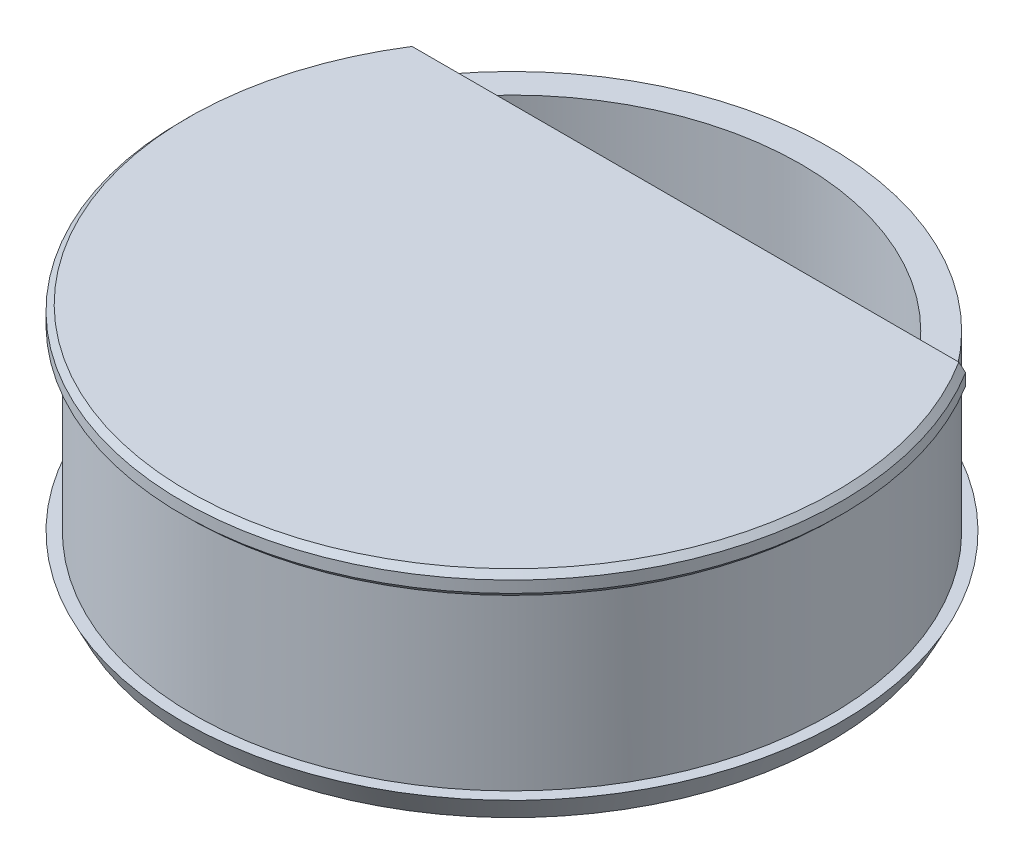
ISO-10303-21;
HEADER;
FILE_DESCRIPTION(('STEP AP214'),'2;1');
FILE_NAME('part.step','',(''),(''),'','','');
FILE_SCHEMA(('AUTOMOTIVE_DESIGN { 1 0 10303 214 1 1 1 1 }'));
ENDSEC;
DATA;
#1=APPLICATION_CONTEXT('core data for automotive mechanical design processes');
#2=APPLICATION_PROTOCOL_DEFINITION('international standard','automotive_design',2000,#1);
#3=PRODUCT_CONTEXT('',#1,'mechanical');
#4=PRODUCT('Part','Part','',(#3));
#5=PRODUCT_RELATED_PRODUCT_CATEGORY('part','',(#4));
#6=PRODUCT_DEFINITION_FORMATION('','',#4);
#7=PRODUCT_DEFINITION_CONTEXT('part definition',#1,'design');
#8=PRODUCT_DEFINITION('design','',#6,#7);
#9=PRODUCT_DEFINITION_SHAPE('','',#8);
#10=(LENGTH_UNIT() NAMED_UNIT(*) SI_UNIT(.MILLI.,.METRE.));
#11=(NAMED_UNIT(*) PLANE_ANGLE_UNIT() SI_UNIT($,.RADIAN.));
#12=(NAMED_UNIT(*) SI_UNIT($,.STERADIAN.) SOLID_ANGLE_UNIT());
#13=UNCERTAINTY_MEASURE_WITH_UNIT(LENGTH_MEASURE(1.E-05),#10,'distance_accuracy_value','');
#14=(GEOMETRIC_REPRESENTATION_CONTEXT(3) GLOBAL_UNCERTAINTY_ASSIGNED_CONTEXT((#13)) GLOBAL_UNIT_ASSIGNED_CONTEXT((#10,
#11,#12)) REPRESENTATION_CONTEXT('',''));
#15=CARTESIAN_POINT('',(0.,0.,0.));
#16=DIRECTION('',(0.,0.,1.));
#17=DIRECTION('',(1.,0.,0.));
#18=AXIS2_PLACEMENT_3D('',#15,#16,#17);
#19=CARTESIAN_POINT('',(0.,0.,0.));
#20=DIRECTION('',(0.,1.,0.));
#21=DIRECTION('',(0.,0.,1.));
#22=AXIS2_PLACEMENT_3D('',#19,#20,#21);
#23=PLANE('',#22);
#24=DIRECTION('',(1.,0.,0.));
#25=VECTOR('',#24,1.);
#26=CARTESIAN_POINT('',(-24.2332416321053,0.,-15.));
#27=LINE('',#26,#25);
#28=CARTESIAN_POINT('',(23.0488611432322,0.,-15.));
#29=VERTEX_POINT('',#28);
#30=CARTESIAN_POINT('',(23.6431808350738,0.,-15.));
#31=VERTEX_POINT('',#30);
#32=EDGE_CURVE('E92',#29,#31,#27,.T.);
#33=ORIENTED_EDGE('',*,*,#32,.T.);
#34=CARTESIAN_POINT('',(0.,0.,0.));
#35=DIRECTION('',(0.,1.,0.));
#36=DIRECTION('',(0.,0.,1.));
#37=AXIS2_PLACEMENT_3D('',#34,#35,#36);
#38=CIRCLE('',#37,28.);
#39=CARTESIAN_POINT('',(-23.6431808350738,0.,-15.));
#40=VERTEX_POINT('',#39);
#41=EDGE_CURVE('E45',#31,#40,#38,.F.);
#42=ORIENTED_EDGE('',*,*,#41,.T.);
#43=CARTESIAN_POINT('',(-23.0488611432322,0.,-15.));
#44=VERTEX_POINT('',#43);
#45=EDGE_CURVE('E82',#40,#44,#27,.T.);
#46=ORIENTED_EDGE('',*,*,#45,.T.);
#47=CARTESIAN_POINT('',(0.,0.,0.));
#48=DIRECTION('',(0.,1.,0.));
#49=DIRECTION('',(0.,0.,1.));
#50=AXIS2_PLACEMENT_3D('',#47,#48,#49);
#51=CIRCLE('',#50,27.5);
#52=EDGE_CURVE('E85',#29,#44,#51,.F.);
#53=ORIENTED_EDGE('',*,*,#52,.F.);
#54=EDGE_LOOP('',(#33,#42,#46,#53));
#55=FACE_BOUND('',#54,.T.);
#56=ADVANCED_FACE('F30',(#55),#23,.F.);
#57=CARTESIAN_POINT('',(0.,2.,0.));
#58=DIRECTION('',(0.,-1.,0.));
#59=DIRECTION('',(0.,0.,-1.));
#60=AXIS2_PLACEMENT_3D('',#57,#58,#59);
#61=CYLINDRICAL_SURFACE('',#60,28.5);
#62=DIRECTION('',(0.,1.,0.));
#63=VECTOR('',#62,1.);
#64=CARTESIAN_POINT('',(-24.2332416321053,0.,-15.));
#65=LINE('',#64,#63);
#66=CARTESIAN_POINT('',(-24.2332416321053,0.499999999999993,-15.));
#67=VERTEX_POINT('',#66);
#68=CARTESIAN_POINT('',(-24.2332416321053,1.50000000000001,-15.));
#69=VERTEX_POINT('',#68);
#70=EDGE_CURVE('E89',#67,#69,#65,.T.);
#71=ORIENTED_EDGE('',*,*,#70,.F.);
#72=CARTESIAN_POINT('',(0.,0.499999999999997,0.));
#73=DIRECTION('',(0.,1.,0.));
#74=DIRECTION('',(0.,0.,1.));
#75=AXIS2_PLACEMENT_3D('',#72,#73,#74);
#76=CIRCLE('',#75,28.5);
#77=CARTESIAN_POINT('',(24.2332416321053,0.499999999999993,-15.));
#78=VERTEX_POINT('',#77);
#79=EDGE_CURVE('E114',#67,#78,#76,.T.);
#80=ORIENTED_EDGE('',*,*,#79,.T.);
#81=DIRECTION('',(0.,1.,0.));
#82=VECTOR('',#81,1.);
#83=CARTESIAN_POINT('',(24.2332416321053,0.,-15.));
#84=LINE('',#83,#82);
#85=CARTESIAN_POINT('',(24.2332416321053,1.50000000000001,-15.));
#86=VERTEX_POINT('',#85);
#87=EDGE_CURVE('E293',#78,#86,#84,.T.);
#88=ORIENTED_EDGE('',*,*,#87,.T.);
#89=CARTESIAN_POINT('',(0.,1.50000000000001,0.));
#90=DIRECTION('',(0.,1.,0.));
#91=DIRECTION('',(0.,0.,1.));
#92=AXIS2_PLACEMENT_3D('',#89,#90,#91);
#93=CIRCLE('',#92,28.5);
#94=EDGE_CURVE('E101',#86,#69,#93,.F.);
#95=ORIENTED_EDGE('',*,*,#94,.T.);
#96=EDGE_LOOP('',(#71,#80,#88,#95));
#97=FACE_BOUND('',#96,.T.);
#98=ADVANCED_FACE('F154',(#97),#61,.T.);
#99=CARTESIAN_POINT('',(0.,2.,0.));
#100=DIRECTION('',(0.,1.,0.));
#101=DIRECTION('',(0.,0.,1.));
#102=AXIS2_PLACEMENT_3D('',#99,#100,#101);
#103=PLANE('',#102);
#104=DIRECTION('',(1.,0.,0.));
#105=VECTOR('',#104,1.);
#106=CARTESIAN_POINT('',(-24.2332416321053,2.,-15.));
#107=LINE('',#106,#105);
#108=CARTESIAN_POINT('',(-23.6431808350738,2.,-15.));
#109=VERTEX_POINT('',#108);
#110=CARTESIAN_POINT('',(23.6431808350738,2.,-15.));
#111=VERTEX_POINT('',#110);
#112=EDGE_CURVE('E287',#109,#111,#107,.T.);
#113=ORIENTED_EDGE('',*,*,#112,.F.);
#114=CARTESIAN_POINT('',(0.,2.,0.));
#115=DIRECTION('',(0.,1.,0.));
#116=DIRECTION('',(0.,0.,1.));
#117=AXIS2_PLACEMENT_3D('',#114,#115,#116);
#118=CIRCLE('',#117,28.);
#119=EDGE_CURVE('E281',#109,#111,#118,.T.);
#120=ORIENTED_EDGE('',*,*,#119,.T.);
#121=EDGE_LOOP('',(#113,#120));
#122=FACE_BOUND('',#121,.T.);
#123=ADVANCED_FACE('F158',(#122),#103,.T.);
#124=CARTESIAN_POINT('',(0.,-15.,0.));
#125=DIRECTION('',(0.,1.,0.));
#126=DIRECTION('',(0.,0.,1.));
#127=AXIS2_PLACEMENT_3D('',#124,#125,#126);
#128=CYLINDRICAL_SURFACE('',#127,27.5);
#129=CARTESIAN_POINT('',(0.,-15.,0.));
#130=DIRECTION('',(0.,-1.,0.));
#131=DIRECTION('',(0.,0.,-1.));
#132=AXIS2_PLACEMENT_3D('',#129,#130,#131);
#133=CIRCLE('',#132,27.5);
#134=CARTESIAN_POINT('',(0.,-15.,-27.5));
#135=VERTEX_POINT('',#134);
#136=EDGE_CURVE('E107',#135,#135,#133,.T.);
#137=ORIENTED_EDGE('',*,*,#136,.F.);
#138=EDGE_LOOP('',(#137));
#139=FACE_BOUND('',#138,.T.);
#140=EDGE_CURVE('E95',#44,#29,#51,.F.);
#141=ORIENTED_EDGE('',*,*,#140,.T.);
#142=ORIENTED_EDGE('',*,*,#52,.T.);
#143=EDGE_LOOP('',(#141,#142));
#144=FACE_BOUND('',#143,.T.);
#145=ADVANCED_FACE('F106',(#139,#144),#128,.T.);
#146=CARTESIAN_POINT('',(0.,-15.,28.5));
#147=DIRECTION('',(0.,1.,0.));
#148=DIRECTION('',(0.,0.,1.));
#149=AXIS2_PLACEMENT_3D('',#146,#147,#148);
#150=PLANE('',#149);
#151=CARTESIAN_POINT('',(0.,-15.,0.));
#152=DIRECTION('',(0.,1.,0.));
#153=DIRECTION('',(0.,0.,1.));
#154=AXIS2_PLACEMENT_3D('',#151,#152,#153);
#155=CIRCLE('',#154,28.5);
#156=CARTESIAN_POINT('',(0.,-15.,28.5));
#157=VERTEX_POINT('',#156);
#158=EDGE_CURVE('E299',#157,#157,#155,.T.);
#159=ORIENTED_EDGE('',*,*,#158,.T.);
#160=EDGE_LOOP('',(#159));
#161=FACE_BOUND('',#160,.T.);
#162=ORIENTED_EDGE('',*,*,#136,.T.);
#163=EDGE_LOOP('',(#162));
#164=FACE_BOUND('',#163,.T.);
#165=ADVANCED_FACE('F170',(#161,#164),#150,.T.);
#166=CARTESIAN_POINT('',(0.,-15.,0.));
#167=DIRECTION('',(0.,1.,0.));
#168=DIRECTION('',(0.,0.,1.));
#169=AXIS2_PLACEMENT_3D('',#166,#167,#168);
#170=CONICAL_SURFACE('',#169,28.5,0.463647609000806);
#171=CARTESIAN_POINT('',(0.,-17.,0.));
#172=DIRECTION('',(0.,1.,0.));
#173=DIRECTION('',(0.,0.,1.));
#174=AXIS2_PLACEMENT_3D('',#171,#172,#173);
#175=CIRCLE('',#174,27.5);
#176=CARTESIAN_POINT('',(0.,-17.,27.5));
#177=VERTEX_POINT('',#176);
#178=EDGE_CURVE('E297',#177,#177,#175,.T.);
#179=ORIENTED_EDGE('',*,*,#178,.T.);
#180=EDGE_LOOP('',(#179));
#181=FACE_BOUND('',#180,.T.);
#182=ORIENTED_EDGE('',*,*,#158,.F.);
#183=EDGE_LOOP('',(#182));
#184=FACE_BOUND('',#183,.T.);
#185=ADVANCED_FACE('F176',(#181,#184),#170,.T.);
#186=CARTESIAN_POINT('',(0.,-17.,27.5));
#187=DIRECTION('',(0.,-1.,0.));
#188=DIRECTION('',(0.,0.,-1.));
#189=AXIS2_PLACEMENT_3D('',#186,#187,#188);
#190=PLANE('',#189);
#191=CARTESIAN_POINT('',(0.,-17.,0.));
#192=DIRECTION('',(0.,-1.,0.));
#193=DIRECTION('',(0.,0.,-1.));
#194=AXIS2_PLACEMENT_3D('',#191,#192,#193);
#195=CIRCLE('',#194,25.5);
#196=CARTESIAN_POINT('',(0.,-17.,-25.5));
#197=VERTEX_POINT('',#196);
#198=EDGE_CURVE('E38',#197,#197,#195,.F.);
#199=ORIENTED_EDGE('',*,*,#198,.T.);
#200=EDGE_LOOP('',(#199));
#201=FACE_BOUND('',#200,.T.);
#202=ORIENTED_EDGE('',*,*,#178,.F.);
#203=EDGE_LOOP('',(#202));
#204=FACE_BOUND('',#203,.T.);
#205=ADVANCED_FACE('F136',(#201,#204),#190,.T.);
#206=CARTESIAN_POINT('',(0.,0.,0.));
#207=DIRECTION('',(0.,-1.,0.));
#208=DIRECTION('',(0.,0.,-1.));
#209=AXIS2_PLACEMENT_3D('',#206,#207,#208);
#210=CIRCLE('',#209,25.);
#211=CARTESIAN_POINT('',(20.,0.,-15.));
#212=VERTEX_POINT('',#211);
#213=CARTESIAN_POINT('',(-20.,0.,-15.));
#214=VERTEX_POINT('',#213);
#215=EDGE_CURVE('E109',#212,#214,#210,.T.);
#216=ORIENTED_EDGE('',*,*,#215,.T.);
#217=EDGE_CURVE('E105',#214,#212,#27,.T.);
#218=ORIENTED_EDGE('',*,*,#217,.T.);
#219=EDGE_LOOP('',(#216,#218));
#220=FACE_BOUND('',#219,.T.);
#221=ADVANCED_FACE('F160',(#220),#23,.F.);
#222=CARTESIAN_POINT('',(0.,-15.,0.));
#223=DIRECTION('',(0.,1.,0.));
#224=DIRECTION('',(0.,0.,1.));
#225=AXIS2_PLACEMENT_3D('',#222,#223,#224);
#226=CYLINDRICAL_SURFACE('',#225,25.);
#227=CARTESIAN_POINT('',(0.,-16.5,0.));
#228=DIRECTION('',(0.,-1.,0.));
#229=DIRECTION('',(0.,0.,-1.));
#230=AXIS2_PLACEMENT_3D('',#227,#228,#229);
#231=CIRCLE('',#230,25.);
#232=CARTESIAN_POINT('',(0.,-16.5,-25.));
#233=VERTEX_POINT('',#232);
#234=EDGE_CURVE('E11',#233,#233,#231,.T.);
#235=ORIENTED_EDGE('',*,*,#234,.T.);
#236=EDGE_LOOP('',(#235));
#237=FACE_BOUND('',#236,.T.);
#238=ORIENTED_EDGE('',*,*,#215,.F.);
#239=EDGE_CURVE('E295',#214,#212,#210,.T.);
#240=ORIENTED_EDGE('',*,*,#239,.F.);
#241=EDGE_LOOP('',(#238,#240));
#242=FACE_BOUND('',#241,.T.);
#243=ADVANCED_FACE('F163',(#237,#242),#226,.F.);
#244=CARTESIAN_POINT('',(-24.2332416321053,0.,-15.));
#245=DIRECTION('',(0.,1.,0.));
#246=DIRECTION('',(0.,0.,1.));
#247=AXIS2_PLACEMENT_3D('',#244,#245,#246);
#248=PLANE('',#247);
#249=ORIENTED_EDGE('',*,*,#239,.T.);
#250=EDGE_CURVE('E99',#212,#29,#27,.T.);
#251=ORIENTED_EDGE('',*,*,#250,.T.);
#252=ORIENTED_EDGE('',*,*,#140,.F.);
#253=EDGE_CURVE('E90',#44,#214,#27,.T.);
#254=ORIENTED_EDGE('',*,*,#253,.T.);
#255=EDGE_LOOP('',(#249,#251,#252,#254));
#256=FACE_BOUND('',#255,.T.);
#257=ADVANCED_FACE('F97',(#256),#248,.T.);
#258=CARTESIAN_POINT('',(-24.2332416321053,0.,-15.));
#259=DIRECTION('',(0.,0.,1.));
#260=DIRECTION('',(1.,0.,0.));
#261=AXIS2_PLACEMENT_3D('',#258,#259,#260);
#262=PLANE('',#261);
#263=ORIENTED_EDGE('',*,*,#87,.F.);
#264=CARTESIAN_POINT('',(24.2332416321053,0.499999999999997,-15.));
#265=CARTESIAN_POINT('',(24.1350409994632,0.416498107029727,-15.));
#266=CARTESIAN_POINT('',(24.0367689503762,0.333080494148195,-15.));
#267=CARTESIAN_POINT('',(23.8400820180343,0.166413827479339,-15.));
#268=CARTESIAN_POINT('',(23.7416671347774,0.0831647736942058,-15.));
#269=CARTESIAN_POINT('',(23.6431808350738,0.,-15.));
#270=B_SPLINE_CURVE_WITH_KNOTS('',3,(#264,#265,#266,#267,#268,#269),.UNSPECIFIED.,.F.,.F.,(4,2,
4),(0.,0.386707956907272,0.773415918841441),.UNSPECIFIED.);
#271=EDGE_CURVE('E53',#78,#31,#270,.T.);
#272=ORIENTED_EDGE('',*,*,#271,.T.);
#273=ORIENTED_EDGE('',*,*,#32,.F.);
#274=ORIENTED_EDGE('',*,*,#250,.F.);
#275=ORIENTED_EDGE('',*,*,#217,.F.);
#276=ORIENTED_EDGE('',*,*,#253,.F.);
#277=ORIENTED_EDGE('',*,*,#45,.F.);
#278=CARTESIAN_POINT('',(-23.6431808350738,0.,-15.));
#279=CARTESIAN_POINT('',(-23.7416671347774,0.0831647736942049,-15.));
#280=CARTESIAN_POINT('',(-23.8400820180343,0.166413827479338,-15.));
#281=CARTESIAN_POINT('',(-24.0367689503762,0.333080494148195,-15.));
#282=CARTESIAN_POINT('',(-24.1350409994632,0.416498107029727,-15.));
#283=CARTESIAN_POINT('',(-24.2332416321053,0.499999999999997,-15.));
#284=B_SPLINE_CURVE_WITH_KNOTS('',3,(#278,#279,#280,#281,#282,#283),.UNSPECIFIED.,.F.,.F.,(4,2,
4),(0.,0.386707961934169,0.773415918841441),.UNSPECIFIED.);
#285=EDGE_CURVE('E142',#40,#67,#284,.T.);
#286=ORIENTED_EDGE('',*,*,#285,.T.);
#287=ORIENTED_EDGE('',*,*,#70,.T.);
#288=CARTESIAN_POINT('',(-24.2332416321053,1.50000000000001,-15.));
#289=CARTESIAN_POINT('',(-24.1350409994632,1.58350189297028,-15.));
#290=CARTESIAN_POINT('',(-24.0367689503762,1.66691950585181,-15.));
#291=CARTESIAN_POINT('',(-23.8400820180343,1.83358617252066,-15.));
#292=CARTESIAN_POINT('',(-23.7416671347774,1.9168352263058,-15.));
#293=CARTESIAN_POINT('',(-23.6431808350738,2.,-15.));
#294=B_SPLINE_CURVE_WITH_KNOTS('',3,(#288,#289,#290,#291,#292,#293),.UNSPECIFIED.,.F.,.F.,(4,2,
4),(0.,0.386707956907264,0.773415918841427),.UNSPECIFIED.);
#295=EDGE_CURVE('E117',#69,#109,#294,.T.);
#296=ORIENTED_EDGE('',*,*,#295,.T.);
#297=ORIENTED_EDGE('',*,*,#112,.T.);
#298=CARTESIAN_POINT('',(23.6431808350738,2.,-15.));
#299=CARTESIAN_POINT('',(23.7416671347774,1.9168352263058,-15.));
#300=CARTESIAN_POINT('',(23.8400820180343,1.83358617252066,-15.));
#301=CARTESIAN_POINT('',(24.0367689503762,1.66691950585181,-15.));
#302=CARTESIAN_POINT('',(24.1350409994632,1.58350189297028,-15.));
#303=CARTESIAN_POINT('',(24.2332416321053,1.50000000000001,-15.));
#304=B_SPLINE_CURVE_WITH_KNOTS('',3,(#298,#299,#300,#301,#302,#303),.UNSPECIFIED.,.F.,.F.,(4,2,
4),(0.,0.386707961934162,0.773415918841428),.UNSPECIFIED.);
#305=EDGE_CURVE('E123',#111,#86,#304,.T.);
#306=ORIENTED_EDGE('',*,*,#305,.T.);
#307=EDGE_LOOP('',(#263,#272,#273,#274,#275,#276,#277,#286,#287,#296,#297,#306));
#308=FACE_BOUND('',#307,.T.);
#309=ADVANCED_FACE('F103',(#308),#262,.F.);
#310=CARTESIAN_POINT('',(0.,0.499999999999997,0.));
#311=DIRECTION('',(0.,1.,0.));
#312=DIRECTION('',(0.,0.,1.));
#313=AXIS2_PLACEMENT_3D('',#310,#311,#312);
#314=CONICAL_SURFACE('',#313,28.5,0.785398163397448);
#315=ORIENTED_EDGE('',*,*,#285,.F.);
#316=ORIENTED_EDGE('',*,*,#41,.F.);
#317=ORIENTED_EDGE('',*,*,#271,.F.);
#318=ORIENTED_EDGE('',*,*,#79,.F.);
#319=EDGE_LOOP('',(#315,#316,#317,#318));
#320=FACE_BOUND('',#319,.T.);
#321=ADVANCED_FACE('F135',(#320),#314,.T.);
#322=CARTESIAN_POINT('',(0.,2.,0.));
#323=DIRECTION('',(0.,-1.,0.));
#324=DIRECTION('',(0.,0.,-1.));
#325=AXIS2_PLACEMENT_3D('',#322,#323,#324);
#326=CONICAL_SURFACE('',#325,28.,0.785398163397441);
#327=ORIENTED_EDGE('',*,*,#295,.F.);
#328=ORIENTED_EDGE('',*,*,#94,.F.);
#329=ORIENTED_EDGE('',*,*,#305,.F.);
#330=ORIENTED_EDGE('',*,*,#119,.F.);
#331=EDGE_LOOP('',(#327,#328,#329,#330));
#332=FACE_BOUND('',#331,.T.);
#333=ADVANCED_FACE('F128',(#332),#326,.T.);
#334=CARTESIAN_POINT('',(0.,-17.,0.));
#335=DIRECTION('',(0.,-1.,0.));
#336=DIRECTION('',(0.,0.,-1.));
#337=AXIS2_PLACEMENT_3D('',#334,#335,#336);
#338=CONICAL_SURFACE('',#337,25.5,0.785398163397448);
#339=ORIENTED_EDGE('',*,*,#234,.F.);
#340=EDGE_LOOP('',(#339));
#341=FACE_BOUND('',#340,.T.);
#342=ORIENTED_EDGE('',*,*,#198,.F.);
#343=EDGE_LOOP('',(#342));
#344=FACE_BOUND('',#343,.T.);
#345=ADVANCED_FACE('F32',(#341,#344),#338,.F.);
#346=CLOSED_SHELL('',(#56,#98,#123,#145,#165,#185,#205,#221,#243,#257,#309,#321,#333,#345));
#347=MANIFOLD_SOLID_BREP('B2',#346);
#348=ADVANCED_BREP_SHAPE_REPRESENTATION('',(#18,#347),#14);
#349=SHAPE_DEFINITION_REPRESENTATION(#9,#348);
ENDSEC;
END-ISO-10303-21;
